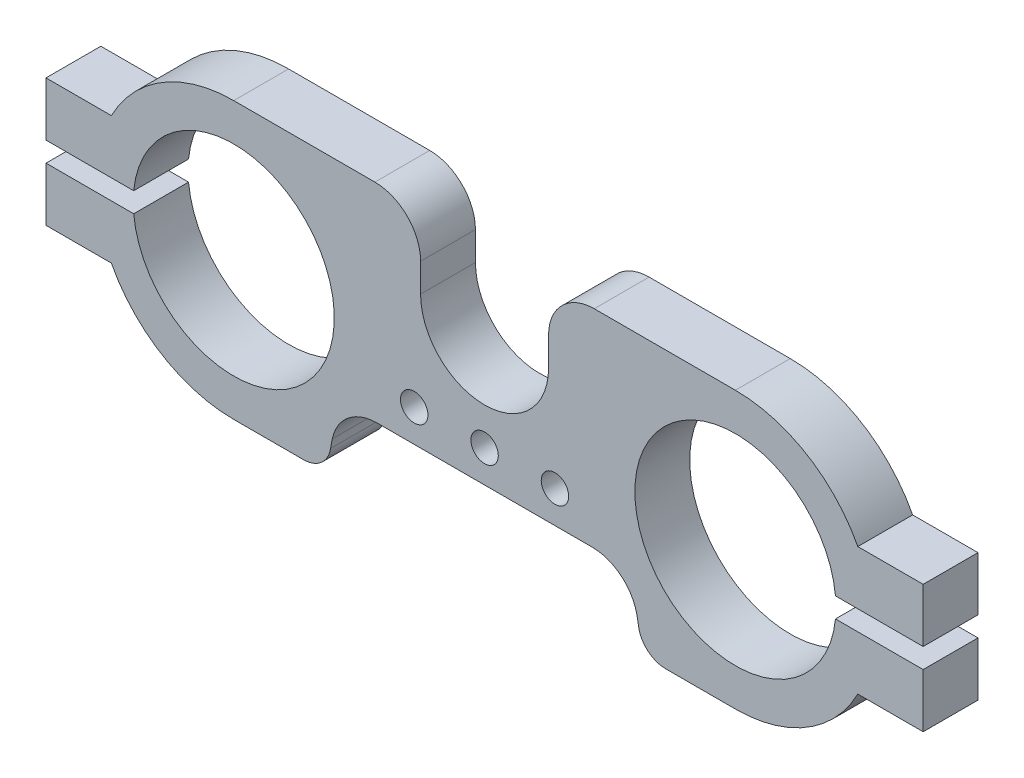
ISO-10303-21;
HEADER;
FILE_DESCRIPTION(('STEP AP214'),'2;1');
FILE_NAME('part.step','',(''),(''),'','','');
FILE_SCHEMA(('AUTOMOTIVE_DESIGN { 1 0 10303 214 1 1 1 1 }'));
ENDSEC;
DATA;
#1=APPLICATION_CONTEXT('core data for automotive mechanical design processes');
#2=APPLICATION_PROTOCOL_DEFINITION('international standard','automotive_design',2000,#1);
#3=PRODUCT_CONTEXT('',#1,'mechanical');
#4=PRODUCT('Part','Part','',(#3));
#5=PRODUCT_RELATED_PRODUCT_CATEGORY('part','',(#4));
#6=PRODUCT_DEFINITION_FORMATION('','',#4);
#7=PRODUCT_DEFINITION_CONTEXT('part definition',#1,'design');
#8=PRODUCT_DEFINITION('design','',#6,#7);
#9=PRODUCT_DEFINITION_SHAPE('','',#8);
#10=(LENGTH_UNIT() NAMED_UNIT(*) SI_UNIT(.MILLI.,.METRE.));
#11=(NAMED_UNIT(*) PLANE_ANGLE_UNIT() SI_UNIT($,.RADIAN.));
#12=(NAMED_UNIT(*) SI_UNIT($,.STERADIAN.) SOLID_ANGLE_UNIT());
#13=UNCERTAINTY_MEASURE_WITH_UNIT(LENGTH_MEASURE(1.E-05),#10,'distance_accuracy_value','');
#14=(GEOMETRIC_REPRESENTATION_CONTEXT(3) GLOBAL_UNCERTAINTY_ASSIGNED_CONTEXT((#13)) GLOBAL_UNIT_ASSIGNED_CONTEXT((#10,
#11,#12)) REPRESENTATION_CONTEXT('',''));
#15=CARTESIAN_POINT('',(0.,0.,0.));
#16=DIRECTION('',(0.,0.,1.));
#17=DIRECTION('',(1.,0.,0.));
#18=AXIS2_PLACEMENT_3D('',#15,#16,#17);
#19=CARTESIAN_POINT('',(-254.782156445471,22.7704220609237,6.));
#20=DIRECTION('',(0.,0.,1.));
#21=DIRECTION('',(1.,0.,0.));
#22=AXIS2_PLACEMENT_3D('',#19,#20,#21);
#23=PLANE('',#22);
#24=CARTESIAN_POINT('',(-219.644215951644,18.6985803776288,6.));
#25=DIRECTION('',(0.,0.,1.));
#26=DIRECTION('',(-1.,0.,0.));
#27=AXIS2_PLACEMENT_3D('',#24,#25,#26);
#28=CIRCLE('',#27,1.5);
#29=CARTESIAN_POINT('',(-221.144215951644,18.6985803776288,6.));
#30=VERTEX_POINT('',#29);
#31=EDGE_CURVE('E981',#30,#30,#28,.T.);
#32=ORIENTED_EDGE('',*,*,#31,.F.);
#33=EDGE_LOOP('',(#32));
#34=FACE_BOUND('',#33,.T.);
#35=CARTESIAN_POINT('',(-254.782156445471,22.7704220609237,6.));
#36=DIRECTION('',(0.,0.,-1.));
#37=DIRECTION('',(1.,0.,0.));
#38=AXIS2_PLACEMENT_3D('',#35,#36,#37);
#39=CIRCLE('',#38,10.9999999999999);
#40=CARTESIAN_POINT('',(-265.72798164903,23.8607938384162,6.));
#41=VERTEX_POINT('',#40);
#42=CARTESIAN_POINT('',(-265.72798164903,21.6800502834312,6.));
#43=VERTEX_POINT('',#42);
#44=EDGE_CURVE('E353',#41,#43,#39,.T.);
#45=ORIENTED_EDGE('',*,*,#44,.T.);
#46=DIRECTION('',(-1.,0.,0.));
#47=VECTOR('',#46,1.);
#48=CARTESIAN_POINT('',(-275.320637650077,21.6800502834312,6.));
#49=LINE('',#48,#47);
#50=CARTESIAN_POINT('',(-275.320637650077,21.6800502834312,6.));
#51=VERTEX_POINT('',#50);
#52=EDGE_CURVE('E167',#43,#51,#49,.T.);
#53=ORIENTED_EDGE('',*,*,#52,.T.);
#54=DIRECTION('',(0.,-1.,0.));
#55=VECTOR('',#54,1.);
#56=CARTESIAN_POINT('',(-275.320637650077,18.4639586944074,6.));
#57=LINE('',#56,#55);
#58=CARTESIAN_POINT('',(-275.320637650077,15.7838823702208,6.));
#59=VERTEX_POINT('',#58);
#60=EDGE_CURVE('E445',#51,#59,#57,.T.);
#61=ORIENTED_EDGE('',*,*,#60,.T.);
#62=DIRECTION('',(1.,0.,0.));
#63=VECTOR('',#62,1.);
#64=CARTESIAN_POINT('',(-275.320637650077,15.7838823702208,6.));
#65=LINE('',#64,#63);
#66=CARTESIAN_POINT('',(-268.172421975,15.7838823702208,6.));
#67=VERTEX_POINT('',#66);
#68=EDGE_CURVE('E466',#59,#67,#65,.T.);
#69=ORIENTED_EDGE('',*,*,#68,.T.);
#70=CARTESIAN_POINT('',(-254.782156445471,22.7704220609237,6.));
#71=DIRECTION('',(0.,0.,1.));
#72=DIRECTION('',(1.,0.,0.));
#73=AXIS2_PLACEMENT_3D('',#70,#71,#72);
#74=CIRCLE('',#73,15.1033422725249);
#75=CARTESIAN_POINT('',(-254.782156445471,7.66707978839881,6.));
#76=VERTEX_POINT('',#75);
#77=EDGE_CURVE('E463',#67,#76,#74,.T.);
#78=ORIENTED_EDGE('',*,*,#77,.T.);
#79=DIRECTION('',(1.,0.,0.));
#80=VECTOR('',#79,1.);
#81=CARTESIAN_POINT('',(-247.152311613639,7.66707978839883,6.));
#82=LINE('',#81,#80);
#83=CARTESIAN_POINT('',(-247.152311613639,7.66707978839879,6.));
#84=VERTEX_POINT('',#83);
#85=EDGE_CURVE('E465',#76,#84,#82,.T.);
#86=ORIENTED_EDGE('',*,*,#85,.T.);
#87=CARTESIAN_POINT('',(-247.152311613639,10.6670797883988,6.));
#88=DIRECTION('',(0.,0.,1.));
#89=DIRECTION('',(-1.,0.,0.));
#90=AXIS2_PLACEMENT_3D('',#87,#88,#89);
#91=CIRCLE('',#90,3.00000000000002);
#92=CARTESIAN_POINT('',(-244.186130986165,10.217888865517,6.));
#93=VERTEX_POINT('',#92);
#94=EDGE_CURVE('E468',#84,#93,#91,.T.);
#95=ORIENTED_EDGE('',*,*,#94,.T.);
#96=CARTESIAN_POINT('',(-227.342156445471,7.66707978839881,6.));
#97=DIRECTION('',(0.,0.,-1.));
#98=DIRECTION('',(1.,0.,0.));
#99=AXIS2_PLACEMENT_3D('',#96,#97,#98);
#100=CIRCLE('',#99,17.0360237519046);
#101=CARTESIAN_POINT('',(-244.004795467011,11.2142710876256,6.));
#102=VERTEX_POINT('',#101);
#103=EDGE_CURVE('E474',#93,#102,#100,.T.);
#104=ORIENTED_EDGE('',*,*,#103,.T.);
#105=CARTESIAN_POINT('',(-239.114382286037,10.1731856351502,6.));
#106=DIRECTION('',(0.,0.,-1.));
#107=DIRECTION('',(1.,0.,0.));
#108=AXIS2_PLACEMENT_3D('',#105,#106,#107);
#109=CIRCLE('',#108,5.00000000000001);
#110=CARTESIAN_POINT('',(-239.114382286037,15.1731856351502,6.));
#111=VERTEX_POINT('',#110);
#112=EDGE_CURVE('E476',#102,#111,#109,.T.);
#113=ORIENTED_EDGE('',*,*,#112,.T.);
#114=DIRECTION('',(1.,0.,0.));
#115=VECTOR('',#114,1.);
#116=CARTESIAN_POINT('',(-239.114382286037,15.1731856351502,6.));
#117=LINE('',#116,#115);
#118=CARTESIAN_POINT('',(-215.569930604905,15.1731856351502,6.));
#119=VERTEX_POINT('',#118);
#120=EDGE_CURVE('E478',#111,#119,#117,.T.);
#121=ORIENTED_EDGE('',*,*,#120,.T.);
#122=CARTESIAN_POINT('',(-215.569930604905,10.1731856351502,6.));
#123=DIRECTION('',(0.,0.,-1.));
#124=DIRECTION('',(1.,0.,0.));
#125=AXIS2_PLACEMENT_3D('',#122,#123,#124);
#126=CIRCLE('',#125,5.);
#127=CARTESIAN_POINT('',(-210.679517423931,11.2142710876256,6.));
#128=VERTEX_POINT('',#127);
#129=EDGE_CURVE('E480',#119,#128,#126,.T.);
#130=ORIENTED_EDGE('',*,*,#129,.T.);
#131=CARTESIAN_POINT('',(-227.342156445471,7.66707978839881,6.));
#132=DIRECTION('',(0.,0.,-1.));
#133=DIRECTION('',(1.,0.,0.));
#134=AXIS2_PLACEMENT_3D('',#131,#132,#133);
#135=CIRCLE('',#134,17.0360237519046);
#136=CARTESIAN_POINT('',(-210.498181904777,10.217888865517,6.));
#137=VERTEX_POINT('',#136);
#138=EDGE_CURVE('E482',#128,#137,#135,.T.);
#139=ORIENTED_EDGE('',*,*,#138,.T.);
#140=CARTESIAN_POINT('',(-207.532001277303,10.6670797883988,6.));
#141=DIRECTION('',(0.,0.,1.));
#142=DIRECTION('',(-1.,0.,0.));
#143=AXIS2_PLACEMENT_3D('',#140,#141,#142);
#144=CIRCLE('',#143,3.);
#145=CARTESIAN_POINT('',(-207.532001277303,7.66707978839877,6.));
#146=VERTEX_POINT('',#145);
#147=EDGE_CURVE('E484',#137,#146,#144,.T.);
#148=ORIENTED_EDGE('',*,*,#147,.T.);
#149=DIRECTION('',(1.,0.,0.));
#150=VECTOR('',#149,1.);
#151=CARTESIAN_POINT('',(-199.902156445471,7.66707978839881,6.));
#152=LINE('',#151,#150);
#153=CARTESIAN_POINT('',(-199.902156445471,7.66707978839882,6.));
#154=VERTEX_POINT('',#153);
#155=EDGE_CURVE('E486',#146,#154,#152,.T.);
#156=ORIENTED_EDGE('',*,*,#155,.T.);
#157=CARTESIAN_POINT('',(-199.902156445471,22.7704220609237,6.));
#158=DIRECTION('',(0.,0.,1.));
#159=DIRECTION('',(1.,0.,0.));
#160=AXIS2_PLACEMENT_3D('',#157,#158,#159);
#161=CIRCLE('',#160,15.1033422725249);
#162=CARTESIAN_POINT('',(-186.511890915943,15.7838823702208,6.));
#163=VERTEX_POINT('',#162);
#164=EDGE_CURVE('E488',#154,#163,#161,.T.);
#165=ORIENTED_EDGE('',*,*,#164,.T.);
#166=DIRECTION('',(1.,0.,0.));
#167=VECTOR('',#166,1.);
#168=CARTESIAN_POINT('',(-179.363675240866,15.7838823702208,6.));
#169=LINE('',#168,#167);
#170=CARTESIAN_POINT('',(-179.363675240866,15.7838823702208,6.));
#171=VERTEX_POINT('',#170);
#172=EDGE_CURVE('E490',#163,#171,#169,.T.);
#173=ORIENTED_EDGE('',*,*,#172,.T.);
#174=DIRECTION('',(0.,1.,0.));
#175=VECTOR('',#174,1.);
#176=CARTESIAN_POINT('',(-179.363675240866,18.4639586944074,6.));
#177=LINE('',#176,#175);
#178=CARTESIAN_POINT('',(-179.363675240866,21.6800502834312,6.));
#179=VERTEX_POINT('',#178);
#180=EDGE_CURVE('E492',#171,#179,#177,.T.);
#181=ORIENTED_EDGE('',*,*,#180,.T.);
#182=DIRECTION('',(-1.,0.,0.));
#183=VECTOR('',#182,1.);
#184=CARTESIAN_POINT('',(-179.363675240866,21.6800502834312,6.));
#185=LINE('',#184,#183);
#186=CARTESIAN_POINT('',(-188.956331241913,21.6800502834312,6.));
#187=VERTEX_POINT('',#186);
#188=EDGE_CURVE('E494',#179,#187,#185,.T.);
#189=ORIENTED_EDGE('',*,*,#188,.T.);
#190=CARTESIAN_POINT('',(-199.902156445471,22.7704220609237,6.));
#191=DIRECTION('',(0.,0.,-1.));
#192=DIRECTION('',(-1.,0.,0.));
#193=AXIS2_PLACEMENT_3D('',#190,#191,#192);
#194=CIRCLE('',#193,10.9999999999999);
#195=CARTESIAN_POINT('',(-188.956331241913,23.8607938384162,6.));
#196=VERTEX_POINT('',#195);
#197=EDGE_CURVE('E496',#187,#196,#194,.T.);
#198=ORIENTED_EDGE('',*,*,#197,.T.);
#199=DIRECTION('',(1.,0.,0.));
#200=VECTOR('',#199,1.);
#201=CARTESIAN_POINT('',(-179.363675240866,23.8607938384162,6.));
#202=LINE('',#201,#200);
#203=CARTESIAN_POINT('',(-179.363675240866,23.8607938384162,6.));
#204=VERTEX_POINT('',#203);
#205=EDGE_CURVE('E498',#196,#204,#202,.T.);
#206=ORIENTED_EDGE('',*,*,#205,.T.);
#207=DIRECTION('',(0.,1.,0.));
#208=VECTOR('',#207,1.);
#209=CARTESIAN_POINT('',(-179.363675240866,23.8607938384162,6.));
#210=LINE('',#209,#208);
#211=CARTESIAN_POINT('',(-179.363675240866,29.7569617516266,6.));
#212=VERTEX_POINT('',#211);
#213=EDGE_CURVE('E500',#204,#212,#210,.T.);
#214=ORIENTED_EDGE('',*,*,#213,.T.);
#215=DIRECTION('',(-1.,0.,0.));
#216=VECTOR('',#215,1.);
#217=CARTESIAN_POINT('',(-179.363675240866,29.7569617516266,6.));
#218=LINE('',#217,#216);
#219=CARTESIAN_POINT('',(-186.511890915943,29.7569617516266,6.));
#220=VERTEX_POINT('',#219);
#221=EDGE_CURVE('E502',#212,#220,#218,.T.);
#222=ORIENTED_EDGE('',*,*,#221,.T.);
#223=CARTESIAN_POINT('',(-199.902156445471,22.7704220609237,6.));
#224=DIRECTION('',(0.,0.,1.));
#225=DIRECTION('',(1.,0.,0.));
#226=AXIS2_PLACEMENT_3D('',#223,#224,#225);
#227=CIRCLE('',#226,15.1033422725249);
#228=CARTESIAN_POINT('',(-199.902156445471,37.8737643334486,6.));
#229=VERTEX_POINT('',#228);
#230=EDGE_CURVE('E504',#220,#229,#227,.T.);
#231=ORIENTED_EDGE('',*,*,#230,.T.);
#232=DIRECTION('',(-1.,0.,0.));
#233=VECTOR('',#232,1.);
#234=CARTESIAN_POINT('',(-199.902156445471,37.8737643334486,6.));
#235=LINE('',#234,#233);
#236=CARTESIAN_POINT('',(-215.342156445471,37.8737643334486,6.));
#237=VERTEX_POINT('',#236);
#238=EDGE_CURVE('E506',#229,#237,#235,.T.);
#239=ORIENTED_EDGE('',*,*,#238,.T.);
#240=CARTESIAN_POINT('',(-215.342156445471,32.8737643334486,6.));
#241=DIRECTION('',(0.,0.,1.));
#242=DIRECTION('',(1.,0.,0.));
#243=AXIS2_PLACEMENT_3D('',#240,#241,#242);
#244=CIRCLE('',#243,5.);
#245=CARTESIAN_POINT('',(-220.342156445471,32.8737643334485,6.));
#246=VERTEX_POINT('',#245);
#247=EDGE_CURVE('E508',#237,#246,#244,.T.);
#248=ORIENTED_EDGE('',*,*,#247,.T.);
#249=DIRECTION('',(0.,-1.,0.));
#250=VECTOR('',#249,1.);
#251=CARTESIAN_POINT('',(-220.342156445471,29.7569617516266,6.));
#252=LINE('',#251,#250);
#253=CARTESIAN_POINT('',(-220.342156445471,29.7569617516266,6.));
#254=VERTEX_POINT('',#253);
#255=EDGE_CURVE('E510',#246,#254,#252,.T.);
#256=ORIENTED_EDGE('',*,*,#255,.T.);
#257=CARTESIAN_POINT('',(-227.342156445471,29.7569617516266,6.));
#258=DIRECTION('',(0.,0.,-1.));
#259=DIRECTION('',(1.,0.,0.));
#260=AXIS2_PLACEMENT_3D('',#257,#258,#259);
#261=CIRCLE('',#260,7.00000000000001);
#262=CARTESIAN_POINT('',(-234.342156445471,29.7569617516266,6.));
#263=VERTEX_POINT('',#262);
#264=EDGE_CURVE('E512',#254,#263,#261,.T.);
#265=ORIENTED_EDGE('',*,*,#264,.T.);
#266=DIRECTION('',(0.,1.,0.));
#267=VECTOR('',#266,1.);
#268=CARTESIAN_POINT('',(-234.342156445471,29.7569617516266,6.));
#269=LINE('',#268,#267);
#270=CARTESIAN_POINT('',(-234.342156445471,32.8737643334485,6.));
#271=VERTEX_POINT('',#270);
#272=EDGE_CURVE('E514',#263,#271,#269,.T.);
#273=ORIENTED_EDGE('',*,*,#272,.T.);
#274=CARTESIAN_POINT('',(-239.342156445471,32.8737643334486,6.));
#275=DIRECTION('',(0.,0.,1.));
#276=DIRECTION('',(-1.,0.,0.));
#277=AXIS2_PLACEMENT_3D('',#274,#275,#276);
#278=CIRCLE('',#277,5.);
#279=CARTESIAN_POINT('',(-239.342156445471,37.8737643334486,6.));
#280=VERTEX_POINT('',#279);
#281=EDGE_CURVE('E516',#271,#280,#278,.T.);
#282=ORIENTED_EDGE('',*,*,#281,.T.);
#283=DIRECTION('',(-1.,0.,0.));
#284=VECTOR('',#283,1.);
#285=CARTESIAN_POINT('',(-239.342156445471,37.8737643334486,6.));
#286=LINE('',#285,#284);
#287=CARTESIAN_POINT('',(-254.782156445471,37.8737643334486,6.));
#288=VERTEX_POINT('',#287);
#289=EDGE_CURVE('E518',#280,#288,#286,.T.);
#290=ORIENTED_EDGE('',*,*,#289,.T.);
#291=CARTESIAN_POINT('',(-254.782156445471,22.7704220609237,6.));
#292=DIRECTION('',(0.,0.,1.));
#293=DIRECTION('',(1.,0.,0.));
#294=AXIS2_PLACEMENT_3D('',#291,#292,#293);
#295=CIRCLE('',#294,15.1033422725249);
#296=CARTESIAN_POINT('',(-268.172421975,29.7569617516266,6.));
#297=VERTEX_POINT('',#296);
#298=EDGE_CURVE('E264',#288,#297,#295,.T.);
#299=ORIENTED_EDGE('',*,*,#298,.T.);
#300=DIRECTION('',(-1.,0.,0.));
#301=VECTOR('',#300,1.);
#302=CARTESIAN_POINT('',(-275.320637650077,29.7569617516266,6.));
#303=LINE('',#302,#301);
#304=CARTESIAN_POINT('',(-275.320637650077,29.7569617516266,6.));
#305=VERTEX_POINT('',#304);
#306=EDGE_CURVE('E258',#297,#305,#303,.T.);
#307=ORIENTED_EDGE('',*,*,#306,.T.);
#308=DIRECTION('',(0.,-1.,0.));
#309=VECTOR('',#308,1.);
#310=CARTESIAN_POINT('',(-275.320637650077,27.07688542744,6.));
#311=LINE('',#310,#309);
#312=CARTESIAN_POINT('',(-275.320637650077,23.8607938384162,6.));
#313=VERTEX_POINT('',#312);
#314=EDGE_CURVE('E262',#305,#313,#311,.T.);
#315=ORIENTED_EDGE('',*,*,#314,.T.);
#316=DIRECTION('',(1.,0.,0.));
#317=VECTOR('',#316,1.);
#318=CARTESIAN_POINT('',(-275.320637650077,23.8607938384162,6.));
#319=LINE('',#318,#317);
#320=EDGE_CURVE('E47',#313,#41,#319,.T.);
#321=ORIENTED_EDGE('',*,*,#320,.T.);
#322=EDGE_LOOP('',(#45,#53,#61,#69,#78,#86,#95,#104,#113,#121,#130,#139,#148,#156,#165,#173,
#181,#189,#198,#206,#214,#222,#231,#239,#248,#256,#265,#273,#282,#290,#299,#307,#315,#321));
#323=FACE_BOUND('',#322,.T.);
#324=CARTESIAN_POINT('',(-235.040096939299,18.6985803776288,6.));
#325=DIRECTION('',(0.,0.,1.));
#326=DIRECTION('',(1.,0.,0.));
#327=AXIS2_PLACEMENT_3D('',#324,#325,#326);
#328=CIRCLE('',#327,1.5);
#329=CARTESIAN_POINT('',(-233.540096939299,18.6985803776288,6.));
#330=VERTEX_POINT('',#329);
#331=EDGE_CURVE('E287',#330,#330,#328,.T.);
#332=ORIENTED_EDGE('',*,*,#331,.F.);
#333=EDGE_LOOP('',(#332));
#334=FACE_BOUND('',#333,.T.);
#335=CARTESIAN_POINT('',(-227.342156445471,18.6985803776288,6.));
#336=DIRECTION('',(0.,0.,1.));
#337=DIRECTION('',(1.,0.,0.));
#338=AXIS2_PLACEMENT_3D('',#335,#336,#337);
#339=CIRCLE('',#338,1.5);
#340=CARTESIAN_POINT('',(-225.842156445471,18.6985803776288,6.));
#341=VERTEX_POINT('',#340);
#342=EDGE_CURVE('E987',#341,#341,#339,.T.);
#343=ORIENTED_EDGE('',*,*,#342,.F.);
#344=EDGE_LOOP('',(#343));
#345=FACE_BOUND('',#344,.T.);
#346=ADVANCED_FACE('F30',(#34,#323,#334,#345),#23,.T.);
#347=CARTESIAN_POINT('',(-254.782156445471,22.7704220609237,0.));
#348=DIRECTION('',(0.,0.,1.));
#349=DIRECTION('',(1.,0.,0.));
#350=AXIS2_PLACEMENT_3D('',#347,#348,#349);
#351=PLANE('',#350);
#352=CARTESIAN_POINT('',(-219.644215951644,18.6985803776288,0.));
#353=DIRECTION('',(0.,0.,1.));
#354=DIRECTION('',(-1.,0.,0.));
#355=AXIS2_PLACEMENT_3D('',#352,#353,#354);
#356=CIRCLE('',#355,1.5);
#357=CARTESIAN_POINT('',(-221.144215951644,18.6985803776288,0.));
#358=VERTEX_POINT('',#357);
#359=EDGE_CURVE('E984',#358,#358,#356,.T.);
#360=ORIENTED_EDGE('',*,*,#359,.T.);
#361=EDGE_LOOP('',(#360));
#362=FACE_BOUND('',#361,.T.);
#363=CARTESIAN_POINT('',(-254.782156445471,22.7704220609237,0.));
#364=DIRECTION('',(0.,0.,-1.));
#365=DIRECTION('',(1.,0.,0.));
#366=AXIS2_PLACEMENT_3D('',#363,#364,#365);
#367=CIRCLE('',#366,10.9999999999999);
#368=CARTESIAN_POINT('',(-265.72798164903,23.8607938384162,0.));
#369=VERTEX_POINT('',#368);
#370=CARTESIAN_POINT('',(-265.72798164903,21.6800502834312,0.));
#371=VERTEX_POINT('',#370);
#372=EDGE_CURVE('E283',#369,#371,#367,.T.);
#373=ORIENTED_EDGE('',*,*,#372,.F.);
#374=DIRECTION('',(1.,0.,0.));
#375=VECTOR('',#374,1.);
#376=CARTESIAN_POINT('',(-275.320637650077,23.8607938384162,0.));
#377=LINE('',#376,#375);
#378=CARTESIAN_POINT('',(-275.320637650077,23.8607938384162,0.));
#379=VERTEX_POINT('',#378);
#380=EDGE_CURVE('E159',#379,#369,#377,.T.);
#381=ORIENTED_EDGE('',*,*,#380,.F.);
#382=DIRECTION('',(0.,-1.,0.));
#383=VECTOR('',#382,1.);
#384=CARTESIAN_POINT('',(-275.320637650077,23.8607938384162,0.));
#385=LINE('',#384,#383);
#386=CARTESIAN_POINT('',(-275.320637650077,29.7569617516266,0.));
#387=VERTEX_POINT('',#386);
#388=EDGE_CURVE('E153',#387,#379,#385,.T.);
#389=ORIENTED_EDGE('',*,*,#388,.F.);
#390=DIRECTION('',(-1.,0.,0.));
#391=VECTOR('',#390,1.);
#392=CARTESIAN_POINT('',(-275.320637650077,29.7569617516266,0.));
#393=LINE('',#392,#391);
#394=CARTESIAN_POINT('',(-268.172421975,29.7569617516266,0.));
#395=VERTEX_POINT('',#394);
#396=EDGE_CURVE('E273',#395,#387,#393,.T.);
#397=ORIENTED_EDGE('',*,*,#396,.F.);
#398=CARTESIAN_POINT('',(-254.782156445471,22.7704220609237,0.));
#399=DIRECTION('',(0.,0.,1.));
#400=DIRECTION('',(1.,0.,0.));
#401=AXIS2_PLACEMENT_3D('',#398,#399,#400);
#402=CIRCLE('',#401,15.1033422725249);
#403=CARTESIAN_POINT('',(-254.782156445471,37.8737643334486,0.));
#404=VERTEX_POINT('',#403);
#405=EDGE_CURVE('E348',#404,#395,#402,.T.);
#406=ORIENTED_EDGE('',*,*,#405,.F.);
#407=DIRECTION('',(-1.,0.,0.));
#408=VECTOR('',#407,1.);
#409=CARTESIAN_POINT('',(-239.342156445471,37.8737643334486,0.));
#410=LINE('',#409,#408);
#411=CARTESIAN_POINT('',(-239.342156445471,37.8737643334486,0.));
#412=VERTEX_POINT('',#411);
#413=EDGE_CURVE('E346',#412,#404,#410,.T.);
#414=ORIENTED_EDGE('',*,*,#413,.F.);
#415=CARTESIAN_POINT('',(-239.342156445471,32.8737643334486,0.));
#416=DIRECTION('',(0.,0.,1.));
#417=DIRECTION('',(-1.,0.,0.));
#418=AXIS2_PLACEMENT_3D('',#415,#416,#417);
#419=CIRCLE('',#418,5.);
#420=CARTESIAN_POINT('',(-234.342156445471,32.8737643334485,0.));
#421=VERTEX_POINT('',#420);
#422=EDGE_CURVE('E344',#421,#412,#419,.T.);
#423=ORIENTED_EDGE('',*,*,#422,.F.);
#424=DIRECTION('',(0.,1.,0.));
#425=VECTOR('',#424,1.);
#426=CARTESIAN_POINT('',(-234.342156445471,29.7569617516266,0.));
#427=LINE('',#426,#425);
#428=CARTESIAN_POINT('',(-234.342156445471,29.7569617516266,0.));
#429=VERTEX_POINT('',#428);
#430=EDGE_CURVE('E342',#429,#421,#427,.T.);
#431=ORIENTED_EDGE('',*,*,#430,.F.);
#432=CARTESIAN_POINT('',(-227.342156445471,29.7569617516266,0.));
#433=DIRECTION('',(0.,0.,-1.));
#434=DIRECTION('',(1.,0.,0.));
#435=AXIS2_PLACEMENT_3D('',#432,#433,#434);
#436=CIRCLE('',#435,7.00000000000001);
#437=CARTESIAN_POINT('',(-220.342156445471,29.7569617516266,0.));
#438=VERTEX_POINT('',#437);
#439=EDGE_CURVE('E340',#438,#429,#436,.T.);
#440=ORIENTED_EDGE('',*,*,#439,.F.);
#441=DIRECTION('',(0.,-1.,0.));
#442=VECTOR('',#441,1.);
#443=CARTESIAN_POINT('',(-220.342156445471,29.7569617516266,0.));
#444=LINE('',#443,#442);
#445=CARTESIAN_POINT('',(-220.342156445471,32.8737643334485,0.));
#446=VERTEX_POINT('',#445);
#447=EDGE_CURVE('E338',#446,#438,#444,.T.);
#448=ORIENTED_EDGE('',*,*,#447,.F.);
#449=CARTESIAN_POINT('',(-215.342156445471,32.8737643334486,0.));
#450=DIRECTION('',(0.,0.,1.));
#451=DIRECTION('',(1.,0.,0.));
#452=AXIS2_PLACEMENT_3D('',#449,#450,#451);
#453=CIRCLE('',#452,5.);
#454=CARTESIAN_POINT('',(-215.342156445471,37.8737643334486,0.));
#455=VERTEX_POINT('',#454);
#456=EDGE_CURVE('E336',#455,#446,#453,.T.);
#457=ORIENTED_EDGE('',*,*,#456,.F.);
#458=DIRECTION('',(-1.,0.,0.));
#459=VECTOR('',#458,1.);
#460=CARTESIAN_POINT('',(-199.902156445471,37.8737643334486,0.));
#461=LINE('',#460,#459);
#462=CARTESIAN_POINT('',(-199.902156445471,37.8737643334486,0.));
#463=VERTEX_POINT('',#462);
#464=EDGE_CURVE('E334',#463,#455,#461,.T.);
#465=ORIENTED_EDGE('',*,*,#464,.F.);
#466=CARTESIAN_POINT('',(-199.902156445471,22.7704220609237,0.));
#467=DIRECTION('',(0.,0.,1.));
#468=DIRECTION('',(1.,0.,0.));
#469=AXIS2_PLACEMENT_3D('',#466,#467,#468);
#470=CIRCLE('',#469,15.1033422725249);
#471=CARTESIAN_POINT('',(-186.511890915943,29.7569617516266,0.));
#472=VERTEX_POINT('',#471);
#473=EDGE_CURVE('E332',#472,#463,#470,.T.);
#474=ORIENTED_EDGE('',*,*,#473,.F.);
#475=DIRECTION('',(-1.,0.,0.));
#476=VECTOR('',#475,1.);
#477=CARTESIAN_POINT('',(-179.363675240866,29.7569617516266,0.));
#478=LINE('',#477,#476);
#479=CARTESIAN_POINT('',(-179.363675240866,29.7569617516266,0.));
#480=VERTEX_POINT('',#479);
#481=EDGE_CURVE('E330',#480,#472,#478,.T.);
#482=ORIENTED_EDGE('',*,*,#481,.F.);
#483=DIRECTION('',(0.,1.,0.));
#484=VECTOR('',#483,1.);
#485=CARTESIAN_POINT('',(-179.363675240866,27.07688542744,0.));
#486=LINE('',#485,#484);
#487=CARTESIAN_POINT('',(-179.363675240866,23.8607938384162,0.));
#488=VERTEX_POINT('',#487);
#489=EDGE_CURVE('E328',#488,#480,#486,.T.);
#490=ORIENTED_EDGE('',*,*,#489,.F.);
#491=DIRECTION('',(1.,0.,0.));
#492=VECTOR('',#491,1.);
#493=CARTESIAN_POINT('',(-179.363675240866,23.8607938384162,0.));
#494=LINE('',#493,#492);
#495=CARTESIAN_POINT('',(-188.956331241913,23.8607938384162,0.));
#496=VERTEX_POINT('',#495);
#497=EDGE_CURVE('E325',#496,#488,#494,.T.);
#498=ORIENTED_EDGE('',*,*,#497,.F.);
#499=CARTESIAN_POINT('',(-199.902156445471,22.7704220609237,0.));
#500=DIRECTION('',(0.,0.,-1.));
#501=DIRECTION('',(-1.,0.,0.));
#502=AXIS2_PLACEMENT_3D('',#499,#500,#501);
#503=CIRCLE('',#502,10.9999999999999);
#504=CARTESIAN_POINT('',(-188.956331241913,21.6800502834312,0.));
#505=VERTEX_POINT('',#504);
#506=EDGE_CURVE('E323',#505,#496,#503,.T.);
#507=ORIENTED_EDGE('',*,*,#506,.F.);
#508=DIRECTION('',(-1.,0.,0.));
#509=VECTOR('',#508,1.);
#510=CARTESIAN_POINT('',(-179.363675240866,21.6800502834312,0.));
#511=LINE('',#510,#509);
#512=CARTESIAN_POINT('',(-179.363675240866,21.6800502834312,0.));
#513=VERTEX_POINT('',#512);
#514=EDGE_CURVE('E321',#513,#505,#511,.T.);
#515=ORIENTED_EDGE('',*,*,#514,.F.);
#516=DIRECTION('',(0.,1.,0.));
#517=VECTOR('',#516,1.);
#518=CARTESIAN_POINT('',(-179.363675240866,18.4639586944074,0.));
#519=LINE('',#518,#517);
#520=CARTESIAN_POINT('',(-179.363675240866,15.7838823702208,0.));
#521=VERTEX_POINT('',#520);
#522=EDGE_CURVE('E319',#521,#513,#519,.T.);
#523=ORIENTED_EDGE('',*,*,#522,.F.);
#524=DIRECTION('',(1.,0.,0.));
#525=VECTOR('',#524,1.);
#526=CARTESIAN_POINT('',(-179.363675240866,15.7838823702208,0.));
#527=LINE('',#526,#525);
#528=CARTESIAN_POINT('',(-186.511890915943,15.7838823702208,0.));
#529=VERTEX_POINT('',#528);
#530=EDGE_CURVE('E316',#529,#521,#527,.T.);
#531=ORIENTED_EDGE('',*,*,#530,.F.);
#532=CARTESIAN_POINT('',(-199.902156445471,22.7704220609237,0.));
#533=DIRECTION('',(0.,0.,1.));
#534=DIRECTION('',(1.,0.,0.));
#535=AXIS2_PLACEMENT_3D('',#532,#533,#534);
#536=CIRCLE('',#535,15.1033422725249);
#537=CARTESIAN_POINT('',(-199.902156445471,7.66707978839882,0.));
#538=VERTEX_POINT('',#537);
#539=EDGE_CURVE('E314',#538,#529,#536,.T.);
#540=ORIENTED_EDGE('',*,*,#539,.F.);
#541=DIRECTION('',(1.,0.,0.));
#542=VECTOR('',#541,1.);
#543=CARTESIAN_POINT('',(-199.902156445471,7.66707978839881,0.));
#544=LINE('',#543,#542);
#545=CARTESIAN_POINT('',(-207.532001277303,7.66707978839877,0.));
#546=VERTEX_POINT('',#545);
#547=EDGE_CURVE('E312',#546,#538,#544,.T.);
#548=ORIENTED_EDGE('',*,*,#547,.F.);
#549=CARTESIAN_POINT('',(-207.532001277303,10.6670797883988,0.));
#550=DIRECTION('',(0.,0.,1.));
#551=DIRECTION('',(-1.,0.,0.));
#552=AXIS2_PLACEMENT_3D('',#549,#550,#551);
#553=CIRCLE('',#552,3.);
#554=CARTESIAN_POINT('',(-210.498181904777,10.217888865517,0.));
#555=VERTEX_POINT('',#554);
#556=EDGE_CURVE('E310',#555,#546,#553,.T.);
#557=ORIENTED_EDGE('',*,*,#556,.F.);
#558=CARTESIAN_POINT('',(-227.342156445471,7.66707978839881,0.));
#559=DIRECTION('',(0.,0.,-1.));
#560=DIRECTION('',(1.,0.,0.));
#561=AXIS2_PLACEMENT_3D('',#558,#559,#560);
#562=CIRCLE('',#561,17.0360237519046);
#563=CARTESIAN_POINT('',(-210.679517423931,11.2142710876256,0.));
#564=VERTEX_POINT('',#563);
#565=EDGE_CURVE('E308',#564,#555,#562,.T.);
#566=ORIENTED_EDGE('',*,*,#565,.F.);
#567=CARTESIAN_POINT('',(-215.569930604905,10.1731856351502,0.));
#568=DIRECTION('',(0.,0.,-1.));
#569=DIRECTION('',(1.,0.,0.));
#570=AXIS2_PLACEMENT_3D('',#567,#568,#569);
#571=CIRCLE('',#570,5.);
#572=CARTESIAN_POINT('',(-215.569930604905,15.1731856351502,0.));
#573=VERTEX_POINT('',#572);
#574=EDGE_CURVE('E306',#573,#564,#571,.T.);
#575=ORIENTED_EDGE('',*,*,#574,.F.);
#576=DIRECTION('',(1.,0.,0.));
#577=VECTOR('',#576,1.);
#578=CARTESIAN_POINT('',(-239.114382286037,15.1731856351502,0.));
#579=LINE('',#578,#577);
#580=CARTESIAN_POINT('',(-239.114382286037,15.1731856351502,0.));
#581=VERTEX_POINT('',#580);
#582=EDGE_CURVE('E304',#581,#573,#579,.T.);
#583=ORIENTED_EDGE('',*,*,#582,.F.);
#584=CARTESIAN_POINT('',(-239.114382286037,10.1731856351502,0.));
#585=DIRECTION('',(0.,0.,-1.));
#586=DIRECTION('',(1.,0.,0.));
#587=AXIS2_PLACEMENT_3D('',#584,#585,#586);
#588=CIRCLE('',#587,5.00000000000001);
#589=CARTESIAN_POINT('',(-244.004795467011,11.2142710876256,0.));
#590=VERTEX_POINT('',#589);
#591=EDGE_CURVE('E302',#590,#581,#588,.T.);
#592=ORIENTED_EDGE('',*,*,#591,.F.);
#593=CARTESIAN_POINT('',(-227.342156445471,7.66707978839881,0.));
#594=DIRECTION('',(0.,0.,-1.));
#595=DIRECTION('',(1.,0.,0.));
#596=AXIS2_PLACEMENT_3D('',#593,#594,#595);
#597=CIRCLE('',#596,17.0360237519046);
#598=CARTESIAN_POINT('',(-244.186130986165,10.217888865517,0.));
#599=VERTEX_POINT('',#598);
#600=EDGE_CURVE('E300',#599,#590,#597,.T.);
#601=ORIENTED_EDGE('',*,*,#600,.F.);
#602=CARTESIAN_POINT('',(-247.152311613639,10.6670797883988,0.));
#603=DIRECTION('',(0.,0.,1.));
#604=DIRECTION('',(-1.,0.,0.));
#605=AXIS2_PLACEMENT_3D('',#602,#603,#604);
#606=CIRCLE('',#605,3.00000000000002);
#607=CARTESIAN_POINT('',(-247.152311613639,7.66707978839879,0.));
#608=VERTEX_POINT('',#607);
#609=EDGE_CURVE('E298',#608,#599,#606,.T.);
#610=ORIENTED_EDGE('',*,*,#609,.F.);
#611=DIRECTION('',(1.,0.,0.));
#612=VECTOR('',#611,1.);
#613=CARTESIAN_POINT('',(-247.152311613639,7.66707978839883,0.));
#614=LINE('',#613,#612);
#615=CARTESIAN_POINT('',(-254.782156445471,7.66707978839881,0.));
#616=VERTEX_POINT('',#615);
#617=EDGE_CURVE('E296',#616,#608,#614,.T.);
#618=ORIENTED_EDGE('',*,*,#617,.F.);
#619=CARTESIAN_POINT('',(-254.782156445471,22.7704220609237,0.));
#620=DIRECTION('',(0.,0.,1.));
#621=DIRECTION('',(1.,0.,0.));
#622=AXIS2_PLACEMENT_3D('',#619,#620,#621);
#623=CIRCLE('',#622,15.1033422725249);
#624=CARTESIAN_POINT('',(-268.172421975,15.7838823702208,0.));
#625=VERTEX_POINT('',#624);
#626=EDGE_CURVE('E294',#625,#616,#623,.T.);
#627=ORIENTED_EDGE('',*,*,#626,.F.);
#628=DIRECTION('',(1.,0.,0.));
#629=VECTOR('',#628,1.);
#630=CARTESIAN_POINT('',(-275.320637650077,15.7838823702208,0.));
#631=LINE('',#630,#629);
#632=CARTESIAN_POINT('',(-275.320637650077,15.7838823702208,0.));
#633=VERTEX_POINT('',#632);
#634=EDGE_CURVE('E292',#633,#625,#631,.T.);
#635=ORIENTED_EDGE('',*,*,#634,.F.);
#636=DIRECTION('',(0.,-1.,0.));
#637=VECTOR('',#636,1.);
#638=CARTESIAN_POINT('',(-275.320637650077,18.4639586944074,0.));
#639=LINE('',#638,#637);
#640=CARTESIAN_POINT('',(-275.320637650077,21.6800502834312,0.));
#641=VERTEX_POINT('',#640);
#642=EDGE_CURVE('E290',#641,#633,#639,.T.);
#643=ORIENTED_EDGE('',*,*,#642,.F.);
#644=DIRECTION('',(-1.,0.,0.));
#645=VECTOR('',#644,1.);
#646=CARTESIAN_POINT('',(-275.320637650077,21.6800502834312,0.));
#647=LINE('',#646,#645);
#648=EDGE_CURVE('E286',#371,#641,#647,.T.);
#649=ORIENTED_EDGE('',*,*,#648,.F.);
#650=EDGE_LOOP('',(#373,#381,#389,#397,#406,#414,#423,#431,#440,#448,#457,#465,#474,#482,#490,
#498,#507,#515,#523,#531,#540,#548,#557,#566,#575,#583,#592,#601,#610,#618,#627,#635,#643,#649));
#651=FACE_BOUND('',#650,.T.);
#652=CARTESIAN_POINT('',(-235.040096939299,18.6985803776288,0.));
#653=DIRECTION('',(0.,0.,1.));
#654=DIRECTION('',(1.,0.,0.));
#655=AXIS2_PLACEMENT_3D('',#652,#653,#654);
#656=CIRCLE('',#655,1.5);
#657=CARTESIAN_POINT('',(-233.540096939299,18.6985803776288,0.));
#658=VERTEX_POINT('',#657);
#659=EDGE_CURVE('E978',#658,#658,#656,.T.);
#660=ORIENTED_EDGE('',*,*,#659,.T.);
#661=EDGE_LOOP('',(#660));
#662=FACE_BOUND('',#661,.T.);
#663=CARTESIAN_POINT('',(-227.342156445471,18.6985803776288,0.));
#664=DIRECTION('',(0.,0.,1.));
#665=DIRECTION('',(1.,0.,0.));
#666=AXIS2_PLACEMENT_3D('',#663,#664,#665);
#667=CIRCLE('',#666,1.5);
#668=CARTESIAN_POINT('',(-225.842156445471,18.6985803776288,0.));
#669=VERTEX_POINT('',#668);
#670=EDGE_CURVE('E990',#669,#669,#667,.T.);
#671=ORIENTED_EDGE('',*,*,#670,.T.);
#672=EDGE_LOOP('',(#671));
#673=FACE_BOUND('',#672,.T.);
#674=ADVANCED_FACE('F450',(#362,#651,#662,#673),#351,.F.);
#675=CARTESIAN_POINT('',(-254.782156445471,22.7704220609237,6.));
#676=DIRECTION('',(0.,0.,-1.));
#677=DIRECTION('',(-1.,0.,0.));
#678=AXIS2_PLACEMENT_3D('',#675,#676,#677);
#679=CYLINDRICAL_SURFACE('',#678,10.9999999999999);
#680=ORIENTED_EDGE('',*,*,#372,.T.);
#681=DIRECTION('',(0.,0.,-1.));
#682=VECTOR('',#681,1.);
#683=CARTESIAN_POINT('',(-265.72798164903,21.6800502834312,6.));
#684=LINE('',#683,#682);
#685=EDGE_CURVE('E11',#43,#371,#684,.T.);
#686=ORIENTED_EDGE('',*,*,#685,.F.);
#687=ORIENTED_EDGE('',*,*,#44,.F.);
#688=DIRECTION('',(0.,0.,-1.));
#689=VECTOR('',#688,1.);
#690=CARTESIAN_POINT('',(-265.72798164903,23.8607938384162,6.));
#691=LINE('',#690,#689);
#692=EDGE_CURVE('E279',#41,#369,#691,.T.);
#693=ORIENTED_EDGE('',*,*,#692,.T.);
#694=EDGE_LOOP('',(#680,#686,#687,#693));
#695=FACE_BOUND('',#694,.T.);
#696=ADVANCED_FACE('F32',(#695),#679,.F.);
#697=CARTESIAN_POINT('',(-275.320637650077,21.6800502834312,6.));
#698=DIRECTION('',(0.,-1.,0.));
#699=DIRECTION('',(0.,0.,-1.));
#700=AXIS2_PLACEMENT_3D('',#697,#698,#699);
#701=PLANE('',#700);
#702=ORIENTED_EDGE('',*,*,#648,.T.);
#703=DIRECTION('',(0.,0.,-1.));
#704=VECTOR('',#703,1.);
#705=CARTESIAN_POINT('',(-275.320637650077,21.6800502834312,6.));
#706=LINE('',#705,#704);
#707=EDGE_CURVE('E39',#51,#641,#706,.T.);
#708=ORIENTED_EDGE('',*,*,#707,.F.);
#709=ORIENTED_EDGE('',*,*,#52,.F.);
#710=ORIENTED_EDGE('',*,*,#685,.T.);
#711=EDGE_LOOP('',(#702,#708,#709,#710));
#712=FACE_BOUND('',#711,.T.);
#713=ADVANCED_FACE('F446',(#712),#701,.F.);
#714=CARTESIAN_POINT('',(-275.320637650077,18.4639586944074,6.));
#715=DIRECTION('',(1.,0.,0.));
#716=DIRECTION('',(0.,0.,-1.));
#717=AXIS2_PLACEMENT_3D('',#714,#715,#716);
#718=PLANE('',#717);
#719=ORIENTED_EDGE('',*,*,#642,.T.);
#720=DIRECTION('',(0.,0.,-1.));
#721=VECTOR('',#720,1.);
#722=CARTESIAN_POINT('',(-275.320637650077,15.7838823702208,6.));
#723=LINE('',#722,#721);
#724=EDGE_CURVE('E438',#59,#633,#723,.T.);
#725=ORIENTED_EDGE('',*,*,#724,.F.);
#726=ORIENTED_EDGE('',*,*,#60,.F.);
#727=ORIENTED_EDGE('',*,*,#707,.T.);
#728=EDGE_LOOP('',(#719,#725,#726,#727));
#729=FACE_BOUND('',#728,.T.);
#730=ADVANCED_FACE('F443',(#729),#718,.F.);
#731=CARTESIAN_POINT('',(-275.320637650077,15.7838823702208,6.));
#732=DIRECTION('',(0.,1.,0.));
#733=DIRECTION('',(0.,0.,1.));
#734=AXIS2_PLACEMENT_3D('',#731,#732,#733);
#735=PLANE('',#734);
#736=ORIENTED_EDGE('',*,*,#634,.T.);
#737=DIRECTION('',(0.,0.,-1.));
#738=VECTOR('',#737,1.);
#739=CARTESIAN_POINT('',(-268.172421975,15.7838823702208,6.));
#740=LINE('',#739,#738);
#741=EDGE_CURVE('E435',#67,#625,#740,.T.);
#742=ORIENTED_EDGE('',*,*,#741,.F.);
#743=ORIENTED_EDGE('',*,*,#68,.F.);
#744=ORIENTED_EDGE('',*,*,#724,.T.);
#745=EDGE_LOOP('',(#736,#742,#743,#744));
#746=FACE_BOUND('',#745,.T.);
#747=ADVANCED_FACE('F457',(#746),#735,.F.);
#748=CARTESIAN_POINT('',(-254.782156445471,22.7704220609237,6.));
#749=DIRECTION('',(0.,0.,-1.));
#750=DIRECTION('',(-1.,0.,0.));
#751=AXIS2_PLACEMENT_3D('',#748,#749,#750);
#752=CYLINDRICAL_SURFACE('',#751,15.1033422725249);
#753=ORIENTED_EDGE('',*,*,#626,.T.);
#754=DIRECTION('',(0.,0.,-1.));
#755=VECTOR('',#754,1.);
#756=CARTESIAN_POINT('',(-254.782156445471,7.66707978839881,6.));
#757=LINE('',#756,#755);
#758=EDGE_CURVE('E432',#76,#616,#757,.T.);
#759=ORIENTED_EDGE('',*,*,#758,.F.);
#760=ORIENTED_EDGE('',*,*,#77,.F.);
#761=ORIENTED_EDGE('',*,*,#741,.T.);
#762=EDGE_LOOP('',(#753,#759,#760,#761));
#763=FACE_BOUND('',#762,.T.);
#764=ADVANCED_FACE('F461',(#763),#752,.T.);
#765=CARTESIAN_POINT('',(-247.152311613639,7.66707978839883,6.));
#766=DIRECTION('',(0.,1.,0.));
#767=DIRECTION('',(-1.,0.,0.));
#768=AXIS2_PLACEMENT_3D('',#765,#766,#767);
#769=PLANE('',#768);
#770=ORIENTED_EDGE('',*,*,#617,.T.);
#771=DIRECTION('',(0.,0.,-1.));
#772=VECTOR('',#771,1.);
#773=CARTESIAN_POINT('',(-247.152311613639,7.66707978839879,6.));
#774=LINE('',#773,#772);
#775=EDGE_CURVE('E429',#84,#608,#774,.T.);
#776=ORIENTED_EDGE('',*,*,#775,.F.);
#777=ORIENTED_EDGE('',*,*,#85,.F.);
#778=ORIENTED_EDGE('',*,*,#758,.T.);
#779=EDGE_LOOP('',(#770,#776,#777,#778));
#780=FACE_BOUND('',#779,.T.);
#781=ADVANCED_FACE('F642',(#780),#769,.F.);
#782=CARTESIAN_POINT('',(-247.152311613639,10.6670797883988,6.));
#783=DIRECTION('',(0.,0.,-1.));
#784=DIRECTION('',(-1.,0.,0.));
#785=AXIS2_PLACEMENT_3D('',#782,#783,#784);
#786=CYLINDRICAL_SURFACE('',#785,3.00000000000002);
#787=ORIENTED_EDGE('',*,*,#609,.T.);
#788=DIRECTION('',(0.,0.,-1.));
#789=VECTOR('',#788,1.);
#790=CARTESIAN_POINT('',(-244.186130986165,10.217888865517,6.));
#791=LINE('',#790,#789);
#792=EDGE_CURVE('E426',#93,#599,#791,.T.);
#793=ORIENTED_EDGE('',*,*,#792,.F.);
#794=ORIENTED_EDGE('',*,*,#94,.F.);
#795=ORIENTED_EDGE('',*,*,#775,.T.);
#796=EDGE_LOOP('',(#787,#793,#794,#795));
#797=FACE_BOUND('',#796,.T.);
#798=ADVANCED_FACE('F639',(#797),#786,.T.);
#799=CARTESIAN_POINT('',(-227.342156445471,7.66707978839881,6.));
#800=DIRECTION('',(0.,0.,-1.));
#801=DIRECTION('',(-1.,0.,0.));
#802=AXIS2_PLACEMENT_3D('',#799,#800,#801);
#803=CYLINDRICAL_SURFACE('',#802,17.0360237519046);
#804=ORIENTED_EDGE('',*,*,#600,.T.);
#805=DIRECTION('',(0.,0.,-1.));
#806=VECTOR('',#805,1.);
#807=CARTESIAN_POINT('',(-244.004795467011,11.2142710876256,6.));
#808=LINE('',#807,#806);
#809=EDGE_CURVE('E423',#102,#590,#808,.T.);
#810=ORIENTED_EDGE('',*,*,#809,.F.);
#811=ORIENTED_EDGE('',*,*,#103,.F.);
#812=ORIENTED_EDGE('',*,*,#792,.T.);
#813=EDGE_LOOP('',(#804,#810,#811,#812));
#814=FACE_BOUND('',#813,.T.);
#815=ADVANCED_FACE('F635',(#814),#803,.F.);
#816=CARTESIAN_POINT('',(-239.114382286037,10.1731856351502,6.));
#817=DIRECTION('',(0.,0.,-1.));
#818=DIRECTION('',(-1.,0.,0.));
#819=AXIS2_PLACEMENT_3D('',#816,#817,#818);
#820=CYLINDRICAL_SURFACE('',#819,5.00000000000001);
#821=ORIENTED_EDGE('',*,*,#591,.T.);
#822=DIRECTION('',(0.,0.,-1.));
#823=VECTOR('',#822,1.);
#824=CARTESIAN_POINT('',(-239.114382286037,15.1731856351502,6.));
#825=LINE('',#824,#823);
#826=EDGE_CURVE('E420',#111,#581,#825,.T.);
#827=ORIENTED_EDGE('',*,*,#826,.F.);
#828=ORIENTED_EDGE('',*,*,#112,.F.);
#829=ORIENTED_EDGE('',*,*,#809,.T.);
#830=EDGE_LOOP('',(#821,#827,#828,#829));
#831=FACE_BOUND('',#830,.T.);
#832=ADVANCED_FACE('F630',(#831),#820,.F.);
#833=CARTESIAN_POINT('',(-239.114382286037,15.1731856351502,6.));
#834=DIRECTION('',(0.,1.,0.));
#835=DIRECTION('',(0.,0.,1.));
#836=AXIS2_PLACEMENT_3D('',#833,#834,#835);
#837=PLANE('',#836);
#838=ORIENTED_EDGE('',*,*,#582,.T.);
#839=DIRECTION('',(0.,0.,-1.));
#840=VECTOR('',#839,1.);
#841=CARTESIAN_POINT('',(-215.569930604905,15.1731856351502,6.));
#842=LINE('',#841,#840);
#843=EDGE_CURVE('E417',#119,#573,#842,.T.);
#844=ORIENTED_EDGE('',*,*,#843,.F.);
#845=ORIENTED_EDGE('',*,*,#120,.F.);
#846=ORIENTED_EDGE('',*,*,#826,.T.);
#847=EDGE_LOOP('',(#838,#844,#845,#846));
#848=FACE_BOUND('',#847,.T.);
#849=ADVANCED_FACE('F624',(#848),#837,.F.);
#850=CARTESIAN_POINT('',(-215.569930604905,10.1731856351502,6.));
#851=DIRECTION('',(0.,0.,-1.));
#852=DIRECTION('',(-1.,0.,0.));
#853=AXIS2_PLACEMENT_3D('',#850,#851,#852);
#854=CYLINDRICAL_SURFACE('',#853,5.);
#855=ORIENTED_EDGE('',*,*,#574,.T.);
#856=DIRECTION('',(0.,0.,-1.));
#857=VECTOR('',#856,1.);
#858=CARTESIAN_POINT('',(-210.679517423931,11.2142710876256,6.));
#859=LINE('',#858,#857);
#860=EDGE_CURVE('E414',#128,#564,#859,.T.);
#861=ORIENTED_EDGE('',*,*,#860,.F.);
#862=ORIENTED_EDGE('',*,*,#129,.F.);
#863=ORIENTED_EDGE('',*,*,#843,.T.);
#864=EDGE_LOOP('',(#855,#861,#862,#863));
#865=FACE_BOUND('',#864,.T.);
#866=ADVANCED_FACE('F620',(#865),#854,.F.);
#867=CARTESIAN_POINT('',(-227.342156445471,7.66707978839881,6.));
#868=DIRECTION('',(0.,0.,-1.));
#869=DIRECTION('',(-1.,0.,0.));
#870=AXIS2_PLACEMENT_3D('',#867,#868,#869);
#871=CYLINDRICAL_SURFACE('',#870,17.0360237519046);
#872=ORIENTED_EDGE('',*,*,#565,.T.);
#873=DIRECTION('',(0.,0.,-1.));
#874=VECTOR('',#873,1.);
#875=CARTESIAN_POINT('',(-210.498181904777,10.217888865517,6.));
#876=LINE('',#875,#874);
#877=EDGE_CURVE('E411',#137,#555,#876,.T.);
#878=ORIENTED_EDGE('',*,*,#877,.F.);
#879=ORIENTED_EDGE('',*,*,#138,.F.);
#880=ORIENTED_EDGE('',*,*,#860,.T.);
#881=EDGE_LOOP('',(#872,#878,#879,#880));
#882=FACE_BOUND('',#881,.T.);
#883=ADVANCED_FACE('F615',(#882),#871,.F.);
#884=CARTESIAN_POINT('',(-207.532001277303,10.6670797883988,6.));
#885=DIRECTION('',(0.,0.,-1.));
#886=DIRECTION('',(-1.,0.,0.));
#887=AXIS2_PLACEMENT_3D('',#884,#885,#886);
#888=CYLINDRICAL_SURFACE('',#887,3.);
#889=ORIENTED_EDGE('',*,*,#556,.T.);
#890=DIRECTION('',(0.,0.,-1.));
#891=VECTOR('',#890,1.);
#892=CARTESIAN_POINT('',(-207.532001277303,7.66707978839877,6.));
#893=LINE('',#892,#891);
#894=EDGE_CURVE('E408',#146,#546,#893,.T.);
#895=ORIENTED_EDGE('',*,*,#894,.F.);
#896=ORIENTED_EDGE('',*,*,#147,.F.);
#897=ORIENTED_EDGE('',*,*,#877,.T.);
#898=EDGE_LOOP('',(#889,#895,#896,#897));
#899=FACE_BOUND('',#898,.T.);
#900=ADVANCED_FACE('F609',(#899),#888,.T.);
#901=CARTESIAN_POINT('',(-199.902156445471,7.66707978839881,6.));
#902=DIRECTION('',(0.,1.,0.));
#903=DIRECTION('',(-1.,0.,0.));
#904=AXIS2_PLACEMENT_3D('',#901,#902,#903);
#905=PLANE('',#904);
#906=ORIENTED_EDGE('',*,*,#547,.T.);
#907=DIRECTION('',(0.,0.,-1.));
#908=VECTOR('',#907,1.);
#909=CARTESIAN_POINT('',(-199.902156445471,7.66707978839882,6.));
#910=LINE('',#909,#908);
#911=EDGE_CURVE('E405',#154,#538,#910,.T.);
#912=ORIENTED_EDGE('',*,*,#911,.F.);
#913=ORIENTED_EDGE('',*,*,#155,.F.);
#914=ORIENTED_EDGE('',*,*,#894,.T.);
#915=EDGE_LOOP('',(#906,#912,#913,#914));
#916=FACE_BOUND('',#915,.T.);
#917=ADVANCED_FACE('F605',(#916),#905,.F.);
#918=CARTESIAN_POINT('',(-199.902156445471,22.7704220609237,6.));
#919=DIRECTION('',(0.,0.,-1.));
#920=DIRECTION('',(-1.,0.,0.));
#921=AXIS2_PLACEMENT_3D('',#918,#919,#920);
#922=CYLINDRICAL_SURFACE('',#921,15.1033422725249);
#923=ORIENTED_EDGE('',*,*,#539,.T.);
#924=DIRECTION('',(0.,0.,-1.));
#925=VECTOR('',#924,1.);
#926=CARTESIAN_POINT('',(-186.511890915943,15.7838823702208,6.));
#927=LINE('',#926,#925);
#928=EDGE_CURVE('E402',#163,#529,#927,.T.);
#929=ORIENTED_EDGE('',*,*,#928,.F.);
#930=ORIENTED_EDGE('',*,*,#164,.F.);
#931=ORIENTED_EDGE('',*,*,#911,.T.);
#932=EDGE_LOOP('',(#923,#929,#930,#931));
#933=FACE_BOUND('',#932,.T.);
#934=ADVANCED_FACE('F600',(#933),#922,.T.);
#935=CARTESIAN_POINT('',(-179.363675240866,15.7838823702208,6.));
#936=DIRECTION('',(0.,1.,0.));
#937=DIRECTION('',(0.,0.,1.));
#938=AXIS2_PLACEMENT_3D('',#935,#936,#937);
#939=PLANE('',#938);
#940=ORIENTED_EDGE('',*,*,#530,.T.);
#941=DIRECTION('',(0.,0.,-1.));
#942=VECTOR('',#941,1.);
#943=CARTESIAN_POINT('',(-179.363675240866,15.7838823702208,6.));
#944=LINE('',#943,#942);
#945=EDGE_CURVE('E399',#171,#521,#944,.T.);
#946=ORIENTED_EDGE('',*,*,#945,.F.);
#947=ORIENTED_EDGE('',*,*,#172,.F.);
#948=ORIENTED_EDGE('',*,*,#928,.T.);
#949=EDGE_LOOP('',(#940,#946,#947,#948));
#950=FACE_BOUND('',#949,.T.);
#951=ADVANCED_FACE('F594',(#950),#939,.F.);
#952=CARTESIAN_POINT('',(-179.363675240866,18.4639586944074,6.));
#953=DIRECTION('',(-1.,0.,0.));
#954=DIRECTION('',(0.,0.,1.));
#955=AXIS2_PLACEMENT_3D('',#952,#953,#954);
#956=PLANE('',#955);
#957=ORIENTED_EDGE('',*,*,#522,.T.);
#958=DIRECTION('',(0.,0.,-1.));
#959=VECTOR('',#958,1.);
#960=CARTESIAN_POINT('',(-179.363675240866,21.6800502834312,6.));
#961=LINE('',#960,#959);
#962=EDGE_CURVE('E396',#179,#513,#961,.T.);
#963=ORIENTED_EDGE('',*,*,#962,.F.);
#964=ORIENTED_EDGE('',*,*,#180,.F.);
#965=ORIENTED_EDGE('',*,*,#945,.T.);
#966=EDGE_LOOP('',(#957,#963,#964,#965));
#967=FACE_BOUND('',#966,.T.);
#968=ADVANCED_FACE('F590',(#967),#956,.F.);
#969=CARTESIAN_POINT('',(-179.363675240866,21.6800502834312,6.));
#970=DIRECTION('',(0.,-1.,0.));
#971=DIRECTION('',(0.,0.,-1.));
#972=AXIS2_PLACEMENT_3D('',#969,#970,#971);
#973=PLANE('',#972);
#974=ORIENTED_EDGE('',*,*,#514,.T.);
#975=DIRECTION('',(0.,0.,-1.));
#976=VECTOR('',#975,1.);
#977=CARTESIAN_POINT('',(-188.956331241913,21.6800502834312,6.));
#978=LINE('',#977,#976);
#979=EDGE_CURVE('E393',#187,#505,#978,.T.);
#980=ORIENTED_EDGE('',*,*,#979,.F.);
#981=ORIENTED_EDGE('',*,*,#188,.F.);
#982=ORIENTED_EDGE('',*,*,#962,.T.);
#983=EDGE_LOOP('',(#974,#980,#981,#982));
#984=FACE_BOUND('',#983,.T.);
#985=ADVANCED_FACE('F585',(#984),#973,.F.);
#986=CARTESIAN_POINT('',(-199.902156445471,22.7704220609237,6.));
#987=DIRECTION('',(0.,0.,-1.));
#988=DIRECTION('',(-1.,0.,0.));
#989=AXIS2_PLACEMENT_3D('',#986,#987,#988);
#990=CYLINDRICAL_SURFACE('',#989,10.9999999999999);
#991=ORIENTED_EDGE('',*,*,#506,.T.);
#992=DIRECTION('',(0.,0.,-1.));
#993=VECTOR('',#992,1.);
#994=CARTESIAN_POINT('',(-188.956331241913,23.8607938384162,6.));
#995=LINE('',#994,#993);
#996=EDGE_CURVE('E390',#196,#496,#995,.T.);
#997=ORIENTED_EDGE('',*,*,#996,.F.);
#998=ORIENTED_EDGE('',*,*,#197,.F.);
#999=ORIENTED_EDGE('',*,*,#979,.T.);
#1000=EDGE_LOOP('',(#991,#997,#998,#999));
#1001=FACE_BOUND('',#1000,.T.);
#1002=ADVANCED_FACE('F580',(#1001),#990,.F.);
#1003=CARTESIAN_POINT('',(-179.363675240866,23.8607938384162,6.));
#1004=DIRECTION('',(0.,1.,0.));
#1005=DIRECTION('',(0.,0.,1.));
#1006=AXIS2_PLACEMENT_3D('',#1003,#1004,#1005);
#1007=PLANE('',#1006);
#1008=ORIENTED_EDGE('',*,*,#497,.T.);
#1009=DIRECTION('',(0.,0.,-1.));
#1010=VECTOR('',#1009,1.);
#1011=CARTESIAN_POINT('',(-179.363675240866,23.8607938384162,6.));
#1012=LINE('',#1011,#1010);
#1013=EDGE_CURVE('E387',#204,#488,#1012,.T.);
#1014=ORIENTED_EDGE('',*,*,#1013,.F.);
#1015=ORIENTED_EDGE('',*,*,#205,.F.);
#1016=ORIENTED_EDGE('',*,*,#996,.T.);
#1017=EDGE_LOOP('',(#1008,#1014,#1015,#1016));
#1018=FACE_BOUND('',#1017,.T.);
#1019=ADVANCED_FACE('F575',(#1018),#1007,.F.);
#1020=CARTESIAN_POINT('',(-179.363675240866,27.07688542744,6.));
#1021=DIRECTION('',(-1.,0.,0.));
#1022=DIRECTION('',(0.,0.,1.));
#1023=AXIS2_PLACEMENT_3D('',#1020,#1021,#1022);
#1024=PLANE('',#1023);
#1025=ORIENTED_EDGE('',*,*,#489,.T.);
#1026=DIRECTION('',(0.,0.,-1.));
#1027=VECTOR('',#1026,1.);
#1028=CARTESIAN_POINT('',(-179.363675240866,29.7569617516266,6.));
#1029=LINE('',#1028,#1027);
#1030=EDGE_CURVE('E384',#212,#480,#1029,.T.);
#1031=ORIENTED_EDGE('',*,*,#1030,.F.);
#1032=ORIENTED_EDGE('',*,*,#213,.F.);
#1033=ORIENTED_EDGE('',*,*,#1013,.T.);
#1034=EDGE_LOOP('',(#1025,#1031,#1032,#1033));
#1035=FACE_BOUND('',#1034,.T.);
#1036=ADVANCED_FACE('F570',(#1035),#1024,.F.);
#1037=CARTESIAN_POINT('',(-179.363675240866,29.7569617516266,6.));
#1038=DIRECTION('',(0.,-1.,0.));
#1039=DIRECTION('',(0.,0.,-1.));
#1040=AXIS2_PLACEMENT_3D('',#1037,#1038,#1039);
#1041=PLANE('',#1040);
#1042=ORIENTED_EDGE('',*,*,#481,.T.);
#1043=DIRECTION('',(0.,0.,-1.));
#1044=VECTOR('',#1043,1.);
#1045=CARTESIAN_POINT('',(-186.511890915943,29.7569617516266,6.));
#1046=LINE('',#1045,#1044);
#1047=EDGE_CURVE('E381',#220,#472,#1046,.T.);
#1048=ORIENTED_EDGE('',*,*,#1047,.F.);
#1049=ORIENTED_EDGE('',*,*,#221,.F.);
#1050=ORIENTED_EDGE('',*,*,#1030,.T.);
#1051=EDGE_LOOP('',(#1042,#1048,#1049,#1050));
#1052=FACE_BOUND('',#1051,.T.);
#1053=ADVANCED_FACE('F566',(#1052),#1041,.F.);
#1054=CARTESIAN_POINT('',(-199.902156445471,22.7704220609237,6.));
#1055=DIRECTION('',(0.,0.,-1.));
#1056=DIRECTION('',(-1.,0.,0.));
#1057=AXIS2_PLACEMENT_3D('',#1054,#1055,#1056);
#1058=CYLINDRICAL_SURFACE('',#1057,15.1033422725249);
#1059=ORIENTED_EDGE('',*,*,#473,.T.);
#1060=DIRECTION('',(0.,0.,-1.));
#1061=VECTOR('',#1060,1.);
#1062=CARTESIAN_POINT('',(-199.902156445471,37.8737643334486,6.));
#1063=LINE('',#1062,#1061);
#1064=EDGE_CURVE('E378',#229,#463,#1063,.T.);
#1065=ORIENTED_EDGE('',*,*,#1064,.F.);
#1066=ORIENTED_EDGE('',*,*,#230,.F.);
#1067=ORIENTED_EDGE('',*,*,#1047,.T.);
#1068=EDGE_LOOP('',(#1059,#1065,#1066,#1067));
#1069=FACE_BOUND('',#1068,.T.);
#1070=ADVANCED_FACE('F561',(#1069),#1058,.T.);
#1071=CARTESIAN_POINT('',(-199.902156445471,37.8737643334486,6.));
#1072=DIRECTION('',(0.,-1.,0.));
#1073=DIRECTION('',(0.,0.,-1.));
#1074=AXIS2_PLACEMENT_3D('',#1071,#1072,#1073);
#1075=PLANE('',#1074);
#1076=ORIENTED_EDGE('',*,*,#464,.T.);
#1077=DIRECTION('',(0.,0.,-1.));
#1078=VECTOR('',#1077,1.);
#1079=CARTESIAN_POINT('',(-215.342156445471,37.8737643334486,6.));
#1080=LINE('',#1079,#1078);
#1081=EDGE_CURVE('E375',#237,#455,#1080,.T.);
#1082=ORIENTED_EDGE('',*,*,#1081,.F.);
#1083=ORIENTED_EDGE('',*,*,#238,.F.);
#1084=ORIENTED_EDGE('',*,*,#1064,.T.);
#1085=EDGE_LOOP('',(#1076,#1082,#1083,#1084));
#1086=FACE_BOUND('',#1085,.T.);
#1087=ADVANCED_FACE('F556',(#1086),#1075,.F.);
#1088=CARTESIAN_POINT('',(-215.342156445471,32.8737643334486,6.));
#1089=DIRECTION('',(0.,0.,-1.));
#1090=DIRECTION('',(-1.,0.,0.));
#1091=AXIS2_PLACEMENT_3D('',#1088,#1089,#1090);
#1092=CYLINDRICAL_SURFACE('',#1091,5.);
#1093=ORIENTED_EDGE('',*,*,#456,.T.);
#1094=DIRECTION('',(0.,0.,-1.));
#1095=VECTOR('',#1094,1.);
#1096=CARTESIAN_POINT('',(-220.342156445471,32.8737643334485,6.));
#1097=LINE('',#1096,#1095);
#1098=EDGE_CURVE('E372',#246,#446,#1097,.T.);
#1099=ORIENTED_EDGE('',*,*,#1098,.F.);
#1100=ORIENTED_EDGE('',*,*,#247,.F.);
#1101=ORIENTED_EDGE('',*,*,#1081,.T.);
#1102=EDGE_LOOP('',(#1093,#1099,#1100,#1101));
#1103=FACE_BOUND('',#1102,.T.);
#1104=ADVANCED_FACE('F552',(#1103),#1092,.T.);
#1105=CARTESIAN_POINT('',(-220.342156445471,29.7569617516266,6.));
#1106=DIRECTION('',(1.,0.,0.));
#1107=DIRECTION('',(0.,0.,-1.));
#1108=AXIS2_PLACEMENT_3D('',#1105,#1106,#1107);
#1109=PLANE('',#1108);
#1110=ORIENTED_EDGE('',*,*,#447,.T.);
#1111=DIRECTION('',(0.,0.,-1.));
#1112=VECTOR('',#1111,1.);
#1113=CARTESIAN_POINT('',(-220.342156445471,29.7569617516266,6.));
#1114=LINE('',#1113,#1112);
#1115=EDGE_CURVE('E369',#254,#438,#1114,.T.);
#1116=ORIENTED_EDGE('',*,*,#1115,.F.);
#1117=ORIENTED_EDGE('',*,*,#255,.F.);
#1118=ORIENTED_EDGE('',*,*,#1098,.T.);
#1119=EDGE_LOOP('',(#1110,#1116,#1117,#1118));
#1120=FACE_BOUND('',#1119,.T.);
#1121=ADVANCED_FACE('F547',(#1120),#1109,.F.);
#1122=CARTESIAN_POINT('',(-227.342156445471,29.7569617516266,6.));
#1123=DIRECTION('',(0.,0.,-1.));
#1124=DIRECTION('',(-1.,0.,0.));
#1125=AXIS2_PLACEMENT_3D('',#1122,#1123,#1124);
#1126=CYLINDRICAL_SURFACE('',#1125,7.00000000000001);
#1127=ORIENTED_EDGE('',*,*,#439,.T.);
#1128=DIRECTION('',(0.,0.,-1.));
#1129=VECTOR('',#1128,1.);
#1130=CARTESIAN_POINT('',(-234.342156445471,29.7569617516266,6.));
#1131=LINE('',#1130,#1129);
#1132=EDGE_CURVE('E366',#263,#429,#1131,.T.);
#1133=ORIENTED_EDGE('',*,*,#1132,.F.);
#1134=ORIENTED_EDGE('',*,*,#264,.F.);
#1135=ORIENTED_EDGE('',*,*,#1115,.T.);
#1136=EDGE_LOOP('',(#1127,#1133,#1134,#1135));
#1137=FACE_BOUND('',#1136,.T.);
#1138=ADVANCED_FACE('F541',(#1137),#1126,.F.);
#1139=CARTESIAN_POINT('',(-234.342156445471,29.7569617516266,6.));
#1140=DIRECTION('',(-1.,0.,0.));
#1141=DIRECTION('',(0.,0.,1.));
#1142=AXIS2_PLACEMENT_3D('',#1139,#1140,#1141);
#1143=PLANE('',#1142);
#1144=ORIENTED_EDGE('',*,*,#430,.T.);
#1145=DIRECTION('',(0.,0.,-1.));
#1146=VECTOR('',#1145,1.);
#1147=CARTESIAN_POINT('',(-234.342156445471,32.8737643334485,6.));
#1148=LINE('',#1147,#1146);
#1149=EDGE_CURVE('E363',#271,#421,#1148,.T.);
#1150=ORIENTED_EDGE('',*,*,#1149,.F.);
#1151=ORIENTED_EDGE('',*,*,#272,.F.);
#1152=ORIENTED_EDGE('',*,*,#1132,.T.);
#1153=EDGE_LOOP('',(#1144,#1150,#1151,#1152));
#1154=FACE_BOUND('',#1153,.T.);
#1155=ADVANCED_FACE('F537',(#1154),#1143,.F.);
#1156=CARTESIAN_POINT('',(-239.342156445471,32.8737643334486,6.));
#1157=DIRECTION('',(0.,0.,-1.));
#1158=DIRECTION('',(-1.,0.,0.));
#1159=AXIS2_PLACEMENT_3D('',#1156,#1157,#1158);
#1160=CYLINDRICAL_SURFACE('',#1159,5.);
#1161=ORIENTED_EDGE('',*,*,#422,.T.);
#1162=DIRECTION('',(0.,0.,-1.));
#1163=VECTOR('',#1162,1.);
#1164=CARTESIAN_POINT('',(-239.342156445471,37.8737643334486,6.));
#1165=LINE('',#1164,#1163);
#1166=EDGE_CURVE('E360',#280,#412,#1165,.T.);
#1167=ORIENTED_EDGE('',*,*,#1166,.F.);
#1168=ORIENTED_EDGE('',*,*,#281,.F.);
#1169=ORIENTED_EDGE('',*,*,#1149,.T.);
#1170=EDGE_LOOP('',(#1161,#1167,#1168,#1169));
#1171=FACE_BOUND('',#1170,.T.);
#1172=ADVANCED_FACE('F533',(#1171),#1160,.T.);
#1173=CARTESIAN_POINT('',(-239.342156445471,37.8737643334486,6.));
#1174=DIRECTION('',(0.,-1.,0.));
#1175=DIRECTION('',(0.,0.,-1.));
#1176=AXIS2_PLACEMENT_3D('',#1173,#1174,#1175);
#1177=PLANE('',#1176);
#1178=ORIENTED_EDGE('',*,*,#413,.T.);
#1179=DIRECTION('',(0.,0.,-1.));
#1180=VECTOR('',#1179,1.);
#1181=CARTESIAN_POINT('',(-254.782156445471,37.8737643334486,6.));
#1182=LINE('',#1181,#1180);
#1183=EDGE_CURVE('E357',#288,#404,#1182,.T.);
#1184=ORIENTED_EDGE('',*,*,#1183,.F.);
#1185=ORIENTED_EDGE('',*,*,#289,.F.);
#1186=ORIENTED_EDGE('',*,*,#1166,.T.);
#1187=EDGE_LOOP('',(#1178,#1184,#1185,#1186));
#1188=FACE_BOUND('',#1187,.T.);
#1189=ADVANCED_FACE('F524',(#1188),#1177,.F.);
#1190=CARTESIAN_POINT('',(-254.782156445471,22.7704220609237,6.));
#1191=DIRECTION('',(0.,0.,-1.));
#1192=DIRECTION('',(-1.,0.,0.));
#1193=AXIS2_PLACEMENT_3D('',#1190,#1191,#1192);
#1194=CYLINDRICAL_SURFACE('',#1193,15.1033422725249);
#1195=ORIENTED_EDGE('',*,*,#405,.T.);
#1196=DIRECTION('',(0.,0.,-1.));
#1197=VECTOR('',#1196,1.);
#1198=CARTESIAN_POINT('',(-268.172421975,29.7569617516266,6.));
#1199=LINE('',#1198,#1197);
#1200=EDGE_CURVE('E274',#297,#395,#1199,.T.);
#1201=ORIENTED_EDGE('',*,*,#1200,.F.);
#1202=ORIENTED_EDGE('',*,*,#298,.F.);
#1203=ORIENTED_EDGE('',*,*,#1183,.T.);
#1204=EDGE_LOOP('',(#1195,#1201,#1202,#1203));
#1205=FACE_BOUND('',#1204,.T.);
#1206=ADVANCED_FACE('F528',(#1205),#1194,.T.);
#1207=CARTESIAN_POINT('',(-275.320637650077,29.7569617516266,6.));
#1208=DIRECTION('',(0.,-1.,0.));
#1209=DIRECTION('',(0.,0.,-1.));
#1210=AXIS2_PLACEMENT_3D('',#1207,#1208,#1209);
#1211=PLANE('',#1210);
#1212=ORIENTED_EDGE('',*,*,#396,.T.);
#1213=DIRECTION('',(0.,0.,-1.));
#1214=VECTOR('',#1213,1.);
#1215=CARTESIAN_POINT('',(-275.320637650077,29.7569617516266,6.));
#1216=LINE('',#1215,#1214);
#1217=EDGE_CURVE('E270',#305,#387,#1216,.T.);
#1218=ORIENTED_EDGE('',*,*,#1217,.F.);
#1219=ORIENTED_EDGE('',*,*,#306,.F.);
#1220=ORIENTED_EDGE('',*,*,#1200,.T.);
#1221=EDGE_LOOP('',(#1212,#1218,#1219,#1220));
#1222=FACE_BOUND('',#1221,.T.);
#1223=ADVANCED_FACE('F271',(#1222),#1211,.F.);
#1224=CARTESIAN_POINT('',(-275.320637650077,23.8607938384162,6.));
#1225=DIRECTION('',(1.,0.,0.));
#1226=DIRECTION('',(0.,0.,-1.));
#1227=AXIS2_PLACEMENT_3D('',#1224,#1225,#1226);
#1228=PLANE('',#1227);
#1229=ORIENTED_EDGE('',*,*,#388,.T.);
#1230=DIRECTION('',(0.,0.,-1.));
#1231=VECTOR('',#1230,1.);
#1232=CARTESIAN_POINT('',(-275.320637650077,23.8607938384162,6.));
#1233=LINE('',#1232,#1231);
#1234=EDGE_CURVE('E275',#313,#379,#1233,.T.);
#1235=ORIENTED_EDGE('',*,*,#1234,.F.);
#1236=ORIENTED_EDGE('',*,*,#314,.F.);
#1237=ORIENTED_EDGE('',*,*,#1217,.T.);
#1238=EDGE_LOOP('',(#1229,#1235,#1236,#1237));
#1239=FACE_BOUND('',#1238,.T.);
#1240=ADVANCED_FACE('F277',(#1239),#1228,.F.);
#1241=CARTESIAN_POINT('',(-275.320637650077,23.8607938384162,6.));
#1242=DIRECTION('',(0.,1.,0.));
#1243=DIRECTION('',(0.,0.,1.));
#1244=AXIS2_PLACEMENT_3D('',#1241,#1242,#1243);
#1245=PLANE('',#1244);
#1246=ORIENTED_EDGE('',*,*,#380,.T.);
#1247=ORIENTED_EDGE('',*,*,#692,.F.);
#1248=ORIENTED_EDGE('',*,*,#320,.F.);
#1249=ORIENTED_EDGE('',*,*,#1234,.T.);
#1250=EDGE_LOOP('',(#1246,#1247,#1248,#1249));
#1251=FACE_BOUND('',#1250,.T.);
#1252=ADVANCED_FACE('F664',(#1251),#1245,.F.);
#1253=CARTESIAN_POINT('',(-235.040096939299,18.6985803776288,6.));
#1254=DIRECTION('',(0.,0.,-1.));
#1255=DIRECTION('',(-1.,0.,0.));
#1256=AXIS2_PLACEMENT_3D('',#1253,#1254,#1255);
#1257=CYLINDRICAL_SURFACE('',#1256,1.5);
#1258=ORIENTED_EDGE('',*,*,#331,.T.);
#1259=EDGE_LOOP('',(#1258));
#1260=FACE_BOUND('',#1259,.T.);
#1261=ORIENTED_EDGE('',*,*,#659,.F.);
#1262=EDGE_LOOP('',(#1261));
#1263=FACE_BOUND('',#1262,.T.);
#1264=ADVANCED_FACE('F661',(#1260,#1263),#1257,.F.);
#1265=CARTESIAN_POINT('',(-219.644215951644,18.6985803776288,6.));
#1266=DIRECTION('',(0.,0.,-1.));
#1267=DIRECTION('',(-1.,0.,0.));
#1268=AXIS2_PLACEMENT_3D('',#1265,#1266,#1267);
#1269=CYLINDRICAL_SURFACE('',#1268,1.5);
#1270=ORIENTED_EDGE('',*,*,#31,.T.);
#1271=EDGE_LOOP('',(#1270));
#1272=FACE_BOUND('',#1271,.T.);
#1273=ORIENTED_EDGE('',*,*,#359,.F.);
#1274=EDGE_LOOP('',(#1273));
#1275=FACE_BOUND('',#1274,.T.);
#1276=ADVANCED_FACE('F832',(#1272,#1275),#1269,.F.);
#1277=CARTESIAN_POINT('',(-227.342156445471,18.6985803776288,6.));
#1278=DIRECTION('',(0.,0.,-1.));
#1279=DIRECTION('',(-1.,0.,0.));
#1280=AXIS2_PLACEMENT_3D('',#1277,#1278,#1279);
#1281=CYLINDRICAL_SURFACE('',#1280,1.5);
#1282=ORIENTED_EDGE('',*,*,#342,.T.);
#1283=EDGE_LOOP('',(#1282));
#1284=FACE_BOUND('',#1283,.T.);
#1285=ORIENTED_EDGE('',*,*,#670,.F.);
#1286=EDGE_LOOP('',(#1285));
#1287=FACE_BOUND('',#1286,.T.);
#1288=ADVANCED_FACE('F839',(#1284,#1287),#1281,.F.);
#1289=CLOSED_SHELL('',(#346,#674,#696,#713,#730,#747,#764,#781,#798,#815,#832,#849,#866,#883,
#900,#917,#934,#951,#968,#985,#1002,#1019,#1036,#1053,#1070,#1087,#1104,#1121,#1138,#1155,#1172,
#1189,#1206,#1223,#1240,#1252,#1264,#1276,#1288));
#1290=MANIFOLD_SOLID_BREP('B2',#1289);
#1291=ADVANCED_BREP_SHAPE_REPRESENTATION('',(#18,#1290),#14);
#1292=SHAPE_DEFINITION_REPRESENTATION(#9,#1291);
ENDSEC;
END-ISO-10303-21;
